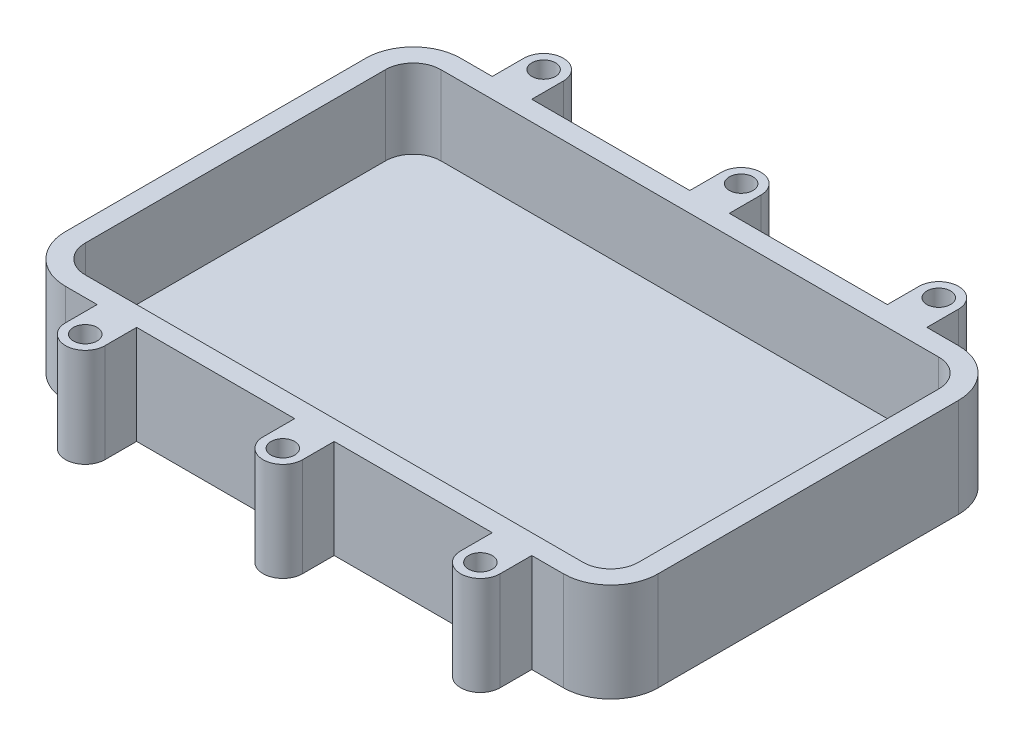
from build123d import *

# Parameters (mm, degrees)
EXTRUDE1_DEPTH           = 25
SHELL1_T                 = -5
EXTRUDE2_DEPTH           = 25
F_6_0_6_DIAMETER_HOLE1_D = 6


with BuildPart() as part:
    # Sketch1 → Extrude1 (new body)
    with BuildSketch(Plane(origin=(0, 0, 0), x_dir=(1, 0, 0), z_dir=(0, 1, 0))):
        with BuildLine():
            Line((63, 50), (-63, 50))
            ThreePointArc((-63, 50), (-71.485281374, 46.485281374), (-75, 38))
            Line((-75, 38), (-75, -38))
            ThreePointArc((-75, -38), (-71.485281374, -46.485281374), (-63, -50))
            Line((-63, -50), (63, -50))
            ThreePointArc((63, -50), (71.485281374, -46.485281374), (75, -38))
            Line((75, -38), (75, 38))
            ThreePointArc((75, 38), (71.485281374, 46.485281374), (63, 50))
        make_face()
    extrude(amount=EXTRUDE1_DEPTH)

    # Shell1
    shell1_openings = [part.faces().sort_by_distance(p)[0] for p in [
        (0, 25, 0),
    ]]
    offset(amount=SHELL1_T, openings=shell1_openings, kind=Kind.INTERSECTION)

    # Sketch2 → Extrude2 (add)
    with BuildSketch(Plane(origin=(0, 25, 0), x_dir=(-1, 0, 0), z_dir=(0, 1, 0))):
        with BuildLine():
            Line((-5, -50), (-5, -58))
            ThreePointArc((-5, -58), (0, -63), (5, -58))
            Line((5, -58), (5, -50))
            Line((5, -50), (-5, -50))
        make_face()
        with BuildLine():
            Line((45, -50), (45, -58))
            ThreePointArc((45, -58), (50, -63), (55, -58))
            Line((55, -58), (55, -50))
            Line((55, -50), (45, -50))
        make_face()
        with BuildLine():
            Line((-55, -50), (-45, -50))
            Line((-45, -50), (-45, -58))
            ThreePointArc((-45, -58), (-50, -63), (-55, -58))
            Line((-55, -58), (-55, -50))
        make_face()
    extrude2 = extrude(amount=-EXTRUDE2_DEPTH)

    # 6.0 _6_ Diameter Hole1 (through all)
    with Locations(Plane(origin=(0, 25, 0), x_dir=(-1, 0, 0), z_dir=(0, 1, 0))):
        with Locations((0, -58), (-50, -58), (50, -58)):
            f_6_0_6_diameter_hole1 = Hole(F_6_0_6_DIAMETER_HOLE1_D / 2)

    # Mirror1: Extrude2, 6.0 _6_ Diameter Hole1 across plane
    add(extrude2.mirror(Plane.XY))
    add(f_6_0_6_diameter_hole1.mirror(Plane.XY), mode=Mode.SUBTRACT)


solid = part.part
